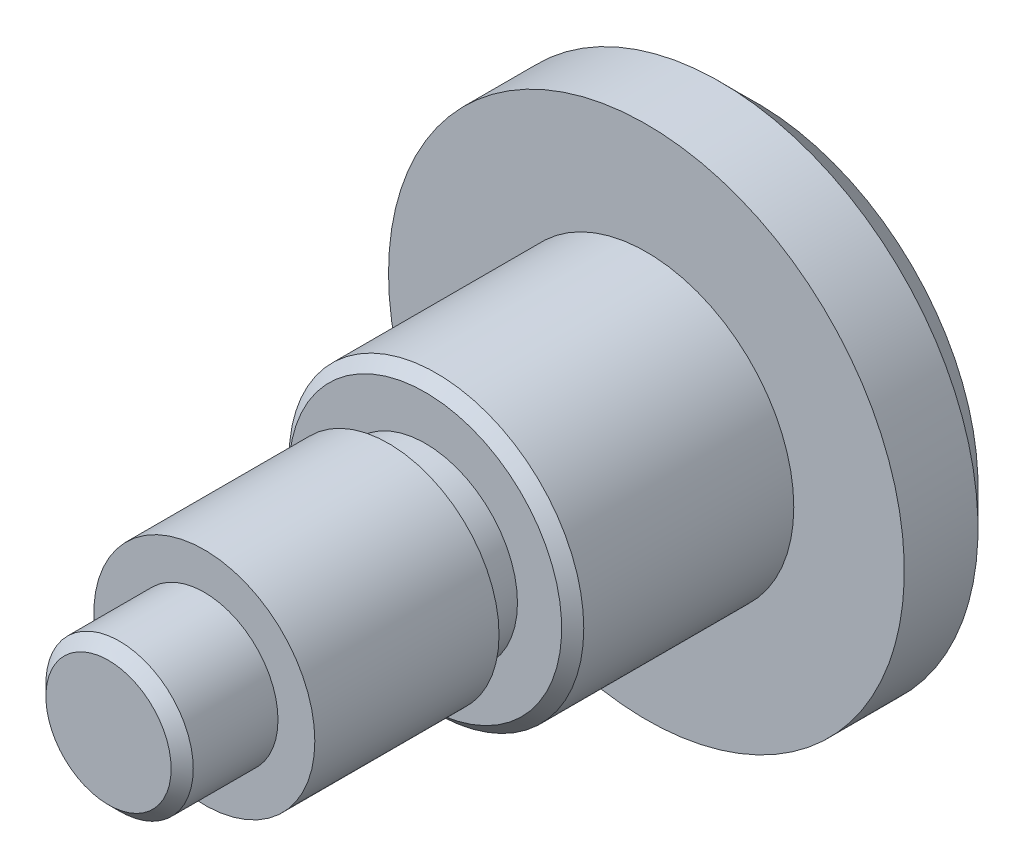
from build123d import *

# Parameters (mm, degrees)
ESQUISSE1_R             = 2
EXTRUSION1_DEPTH        = 3
ESQUISSE2_R             = 3.5
EXTRUSION2_DEPTH        = 1.5
CHANFREIN1_SIZE         = 0.5
ESQUISSE3_R             = 1.25
EXTRUSION3_DEPTH        = 0.5
ESQUISSE4_R             = 1.5
EXTRUSION4_DEPTH        = 2.5
ESQUISSE5_R             = 1
EXTRUSION5_DEPTH        = 1.3
CHANFREIN2_SIZE         = 0.15
ENL_V_MAT_EXTRU_1_DEPTH = 1.5
CHANFREIN4_SIZE         = 0.15


with BuildPart() as part:
    # Esquisse1 → Extrusion1 (new body)
    with BuildSketch(Plane.XY):
        Circle(ESQUISSE1_R)
    extrude(amount=EXTRUSION1_DEPTH)

    # Esquisse2 → Extrusion2 (add)
    with BuildSketch(Plane(origin=(0, 0, 0), x_dir=(-1, 0, 0), z_dir=(0, 0, -1))):
        Circle(ESQUISSE2_R)
    extrude(amount=EXTRUSION2_DEPTH)

    # Chanfrein1
    chanfrein1_edges = [part.edges().sort_by_distance(p)[0] for p in [
        (3.5, 0, -1.5),
    ]]
    chamfer(chanfrein1_edges, length=CHANFREIN1_SIZE)

    # Esquisse3 → Extrusion3 (add)
    with BuildSketch(Plane.XY.offset(3)):
        Circle(ESQUISSE3_R)
    extrude(amount=EXTRUSION3_DEPTH)

    # Esquisse4 → Extrusion4 (add)
    with BuildSketch(Plane.XY.offset(3.5)):
        Circle(ESQUISSE4_R)
    extrude(amount=EXTRUSION4_DEPTH)

    # Esquisse5 → Extrusion5 (add)
    with BuildSketch(Plane.XY.offset(6)):
        Circle(ESQUISSE5_R)
    extrude(amount=EXTRUSION5_DEPTH)

    # Chanfrein2
    chanfrein2_edges = [part.edges().sort_by_distance(p)[0] for p in [
        (-1, 0, 7.3),
    ]]
    chamfer(chanfrein2_edges, length=CHANFREIN2_SIZE)

    # Esquisse9 → Enl_v. mat.-Extru.1 (cut)
    with BuildSketch(Plane(origin=(0, 0, -1.5), x_dir=(-1, 0, 0), z_dir=(0, 0, -1))):
        Polygon((1.006041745, -0.566756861), (0.993846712, 0.587879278), (-0.012195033, 1.154636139), (-1.006041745, 0.566756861), (-0.993846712, -0.587879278), (0.012195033, -1.154636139), align=None)
    extrude(amount=-ENL_V_MAT_EXTRU_1_DEPTH, mode=Mode.SUBTRACT)

    # Enl_v. mat.-Extru.2 cone 1 section (on through the dimple's axis) → Enl_v. mat.-Extru.2 (revolve, cut)
    with BuildSketch(Plane.YZ):
        Polygon((0, 0), (1, 0), (0, 0.577350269), align=None)
    revolve(axis=Axis((0, 0, 0), (0, 0, 1)), mode=Mode.SUBTRACT)

    # Chanfrein4
    chanfrein4_edges = [part.edges().sort_by_distance(p)[0] for p in [
        (-2, 0, 3),
    ]]
    chamfer(chanfrein4_edges, length=CHANFREIN4_SIZE)


solid = part.part
